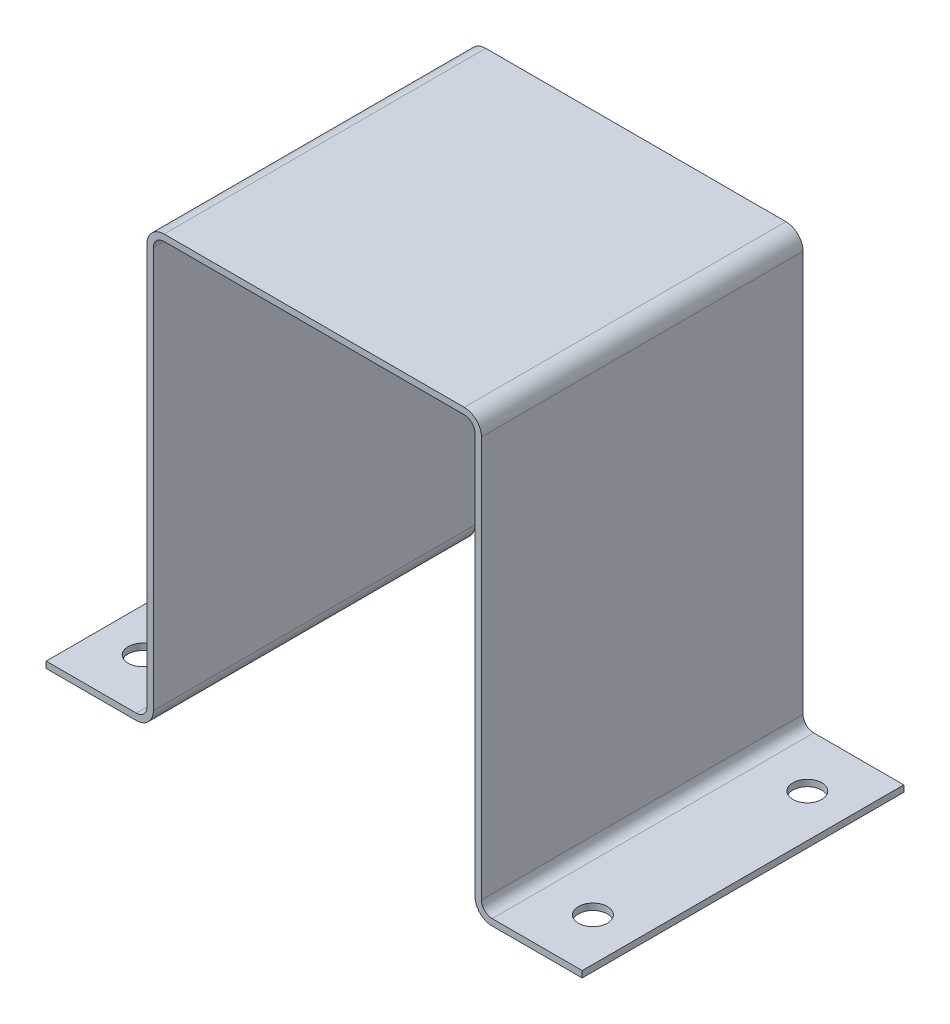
from build123d import *

# Parameters (mm, degrees)
EXTRUDE_THIN1_DEPTH   = 75
M12_CLEARANCE_HOLE1_D = 13.5
MIRROR2_COPY_1_D      = 13.5


with BuildPart() as part:
    # Sketch1 → Extrude-Thin1 (new, symmetric)
    with BuildSketch(Plane.XY):
        with BuildLine():
            Line((-125, -200), (-83, -200))
            ThreePointArc((-83, -200), (-77.343145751, -197.656854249), (-75, -192))
            Line((-75, -192), (-75, -5))
            ThreePointArc((-75, -5), (-73.535533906, -1.464466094), (-70, 0))
            Line((-70, 0), (70, 0))
            ThreePointArc((70, 0), (73.535533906, -1.464466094), (75, -5))
            Line((75, -5), (75, -192))
            ThreePointArc((75, -192), (77.343145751, -197.656854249), (83, -200))
            Line((83, -200), (125, -200))
            Line((125, -200), (125, -197))
            Line((125, -197), (83, -197))
            ThreePointArc((83, -197), (79.464466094, -195.535533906), (78, -192))
            Line((78, -192), (78, -5))
            ThreePointArc((78, -5), (75.656854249, 0.656854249), (70, 3))
            Line((70, 3), (-70, 3))
            ThreePointArc((-70, 3), (-75.656854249, 0.656854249), (-78, -5))
            Line((-78, -5), (-78, -192))
            ThreePointArc((-78, -192), (-79.464466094, -195.535533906), (-83, -197))
            Line((-83, -197), (-125, -197))
            Line((-125, -197), (-125, -200))
        make_face()
    extrude(amount=EXTRUDE_THIN1_DEPTH, both=True)

    # M12 Clearance Hole1 (through all)
    with Locations(Plane(origin=(0, -197, 0), x_dir=(-1, 0, 0), z_dir=(0, 1, 0))):
        with Locations((-105, -50)):
            m12_clearance_hole1 = Hole(M12_CLEARANCE_HOLE1_D / 2)

    # Mirror1: M12 Clearance Hole1 across plane
    add(m12_clearance_hole1.mirror(Plane.XY), mode=Mode.SUBTRACT)

    # Mirror2: M12 Clearance Hole1 across plane
    add(m12_clearance_hole1.mirror(Plane(origin=(0, 0, 0), x_dir=(0, 0, 1), z_dir=(1, 0, 0))), mode=Mode.SUBTRACT)

    # Mirror2 copy 1 (through all)
    with Locations(Plane(origin=(0, -197, 0), x_dir=(1, 0, 0), z_dir=(0, 1, 0))):
        with Locations((-105, -50)):
            Hole(MIRROR2_COPY_1_D / 2)


solid = part.part
